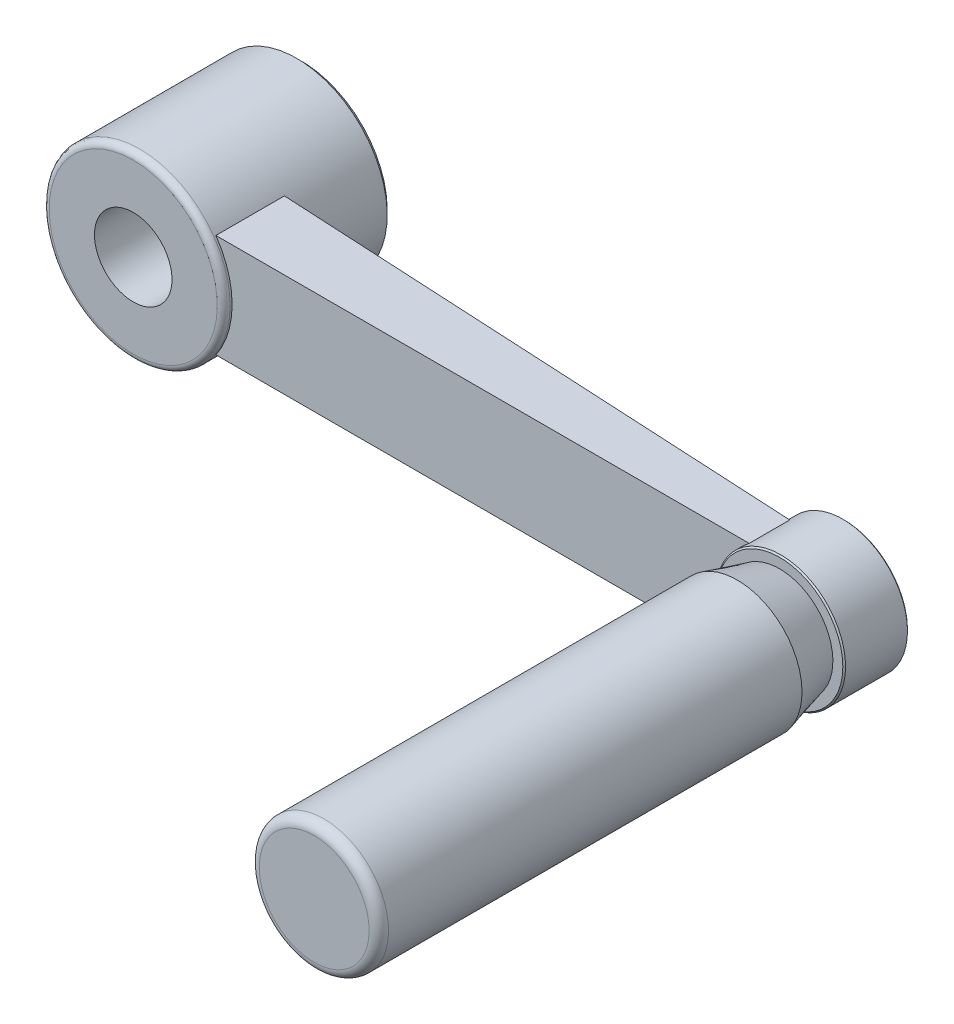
ISO-10303-21;
HEADER;
FILE_DESCRIPTION(('STEP AP214'),'2;1');
FILE_NAME('part.step','',(''),(''),'','','');
FILE_SCHEMA(('AUTOMOTIVE_DESIGN { 1 0 10303 214 1 1 1 1 }'));
ENDSEC;
DATA;
#1=APPLICATION_CONTEXT('core data for automotive mechanical design processes');
#2=APPLICATION_PROTOCOL_DEFINITION('international standard','automotive_design',2000,#1);
#3=PRODUCT_CONTEXT('',#1,'mechanical');
#4=PRODUCT('Part','Part','',(#3));
#5=PRODUCT_RELATED_PRODUCT_CATEGORY('part','',(#4));
#6=PRODUCT_DEFINITION_FORMATION('','',#4);
#7=PRODUCT_DEFINITION_CONTEXT('part definition',#1,'design');
#8=PRODUCT_DEFINITION('design','',#6,#7);
#9=PRODUCT_DEFINITION_SHAPE('','',#8);
#10=(LENGTH_UNIT() NAMED_UNIT(*) SI_UNIT(.MILLI.,.METRE.));
#11=(NAMED_UNIT(*) PLANE_ANGLE_UNIT() SI_UNIT($,.RADIAN.));
#12=(NAMED_UNIT(*) SI_UNIT($,.STERADIAN.) SOLID_ANGLE_UNIT());
#13=UNCERTAINTY_MEASURE_WITH_UNIT(LENGTH_MEASURE(1.E-05),#10,'distance_accuracy_value','');
#14=(GEOMETRIC_REPRESENTATION_CONTEXT(3) GLOBAL_UNCERTAINTY_ASSIGNED_CONTEXT((#13)) GLOBAL_UNIT_ASSIGNED_CONTEXT((#10,
#11,#12)) REPRESENTATION_CONTEXT('',''));
#15=CARTESIAN_POINT('',(0.,0.,0.));
#16=DIRECTION('',(0.,0.,1.));
#17=DIRECTION('',(1.,0.,0.));
#18=AXIS2_PLACEMENT_3D('',#15,#16,#17);
#19=CARTESIAN_POINT('',(102.3865,0.,17.));
#20=DIRECTION('',(0.,0.,1.));
#21=DIRECTION('',(0.,-1.,0.));
#22=AXIS2_PLACEMENT_3D('',#19,#20,#21);
#23=PLANE('',#22);
#24=CARTESIAN_POINT('',(100.,0.,17.0000000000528));
#25=DIRECTION('',(0.,0.,1.));
#26=DIRECTION('',(0.,-1.,0.));
#27=AXIS2_PLACEMENT_3D('',#24,#25,#26);
#28=CIRCLE('',#27,2.38650000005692);
#29=CARTESIAN_POINT('',(100.,-2.38650000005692,17.0000000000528));
#30=VERTEX_POINT('',#29);
#31=EDGE_CURVE('E17',#30,#30,#28,.T.);
#32=ORIENTED_EDGE('',*,*,#31,.F.);
#33=EDGE_LOOP('',(#32));
#34=FACE_BOUND('',#33,.T.);
#35=ADVANCED_FACE('F14',(#34),#23,.F.);
#36=CARTESIAN_POINT('',(100.,0.,17.0719999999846));
#37=DIRECTION('',(0.,0.,1.));
#38=DIRECTION('',(0.,-1.,0.));
#39=AXIS2_PLACEMENT_3D('',#36,#37,#38);
#40=CONICAL_SURFACE('',#39,2.45849999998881,0.785398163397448);
#41=CARTESIAN_POINT('',(100.,0.,17.072));
#42=DIRECTION('',(0.,0.,1.));
#43=DIRECTION('',(0.,-1.,0.));
#44=AXIS2_PLACEMENT_3D('',#41,#42,#43);
#45=CIRCLE('',#44,2.4585);
#46=CARTESIAN_POINT('',(100.,-2.4585,17.072));
#47=VERTEX_POINT('',#46);
#48=EDGE_CURVE('E117',#47,#47,#45,.F.);
#49=ORIENTED_EDGE('',*,*,#48,.T.);
#50=EDGE_LOOP('',(#49));
#51=FACE_BOUND('',#50,.T.);
#52=ORIENTED_EDGE('',*,*,#31,.T.);
#53=EDGE_LOOP('',(#52));
#54=FACE_BOUND('',#53,.T.);
#55=ADVANCED_FACE('F420',(#51,#54),#40,.T.);
#56=CARTESIAN_POINT('',(0.,0.,0.));
#57=DIRECTION('',(0.,0.,1.));
#58=DIRECTION('',(0.,-1.,0.));
#59=AXIS2_PLACEMENT_3D('',#56,#57,#58);
#60=CYLINDRICAL_SURFACE('',#59,6.);
#61=CARTESIAN_POINT('',(0.,0.,26.));
#62=DIRECTION('',(0.,0.,1.));
#63=DIRECTION('',(0.,-1.,0.));
#64=AXIS2_PLACEMENT_3D('',#61,#62,#63);
#65=CIRCLE('',#64,6.);
#66=CARTESIAN_POINT('',(0.,-6.,26.));
#67=VERTEX_POINT('',#66);
#68=EDGE_CURVE('E152',#67,#67,#65,.T.);
#69=ORIENTED_EDGE('',*,*,#68,.T.);
#70=EDGE_LOOP('',(#69));
#71=FACE_BOUND('',#70,.T.);
#72=CARTESIAN_POINT('',(0.,0.,0.));
#73=DIRECTION('',(0.,0.,1.));
#74=DIRECTION('',(0.,-1.,0.));
#75=AXIS2_PLACEMENT_3D('',#72,#73,#74);
#76=CIRCLE('',#75,6.);
#77=CARTESIAN_POINT('',(0.,-6.,0.));
#78=VERTEX_POINT('',#77);
#79=EDGE_CURVE('E125',#78,#78,#76,.F.);
#80=ORIENTED_EDGE('',*,*,#79,.T.);
#81=EDGE_LOOP('',(#80));
#82=FACE_BOUND('',#81,.T.);
#83=ADVANCED_FACE('F157',(#71,#82),#60,.F.);
#84=CARTESIAN_POINT('',(100.,0.,16.));
#85=DIRECTION('',(0.,0.,1.));
#86=DIRECTION('',(0.,-1.,0.));
#87=AXIS2_PLACEMENT_3D('',#84,#85,#86);
#88=CYLINDRICAL_SURFACE('',#87,2.4585);
#89=ORIENTED_EDGE('',*,*,#48,.F.);
#90=EDGE_LOOP('',(#89));
#91=FACE_BOUND('',#90,.T.);
#92=CARTESIAN_POINT('',(100.,0.,16.5415000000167));
#93=DIRECTION('',(0.,0.,-1.));
#94=DIRECTION('',(0.,1.,0.));
#95=AXIS2_PLACEMENT_3D('',#92,#93,#94);
#96=CIRCLE('',#95,2.45849999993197);
#97=CARTESIAN_POINT('',(100.,2.45849999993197,16.5415000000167));
#98=VERTEX_POINT('',#97);
#99=EDGE_CURVE('E97',#98,#98,#96,.T.);
#100=ORIENTED_EDGE('',*,*,#99,.T.);
#101=EDGE_LOOP('',(#100));
#102=FACE_BOUND('',#101,.T.);
#103=ADVANCED_FACE('F162',(#91,#102),#88,.F.);
#104=CARTESIAN_POINT('',(13.2928932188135,0.,0.));
#105=DIRECTION('',(0.,0.,1.));
#106=DIRECTION('',(0.,-1.,0.));
#107=AXIS2_PLACEMENT_3D('',#104,#105,#106);
#108=PLANE('',#107);
#109=CARTESIAN_POINT('',(0.,0.,0.));
#110=DIRECTION('',(0.,0.,1.));
#111=DIRECTION('',(0.,-1.,0.));
#112=AXIS2_PLACEMENT_3D('',#109,#110,#111);
#113=CIRCLE('',#112,13.2928932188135);
#114=CARTESIAN_POINT('',(0.,-13.2928932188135,0.));
#115=VERTEX_POINT('',#114);
#116=EDGE_CURVE('E149',#115,#115,#113,.T.);
#117=ORIENTED_EDGE('',*,*,#116,.F.);
#118=EDGE_LOOP('',(#117));
#119=FACE_BOUND('',#118,.T.);
#120=ORIENTED_EDGE('',*,*,#79,.F.);
#121=EDGE_LOOP('',(#120));
#122=FACE_BOUND('',#121,.T.);
#123=ADVANCED_FACE('F159',(#119,#122),#108,.F.);
#124=CARTESIAN_POINT('',(0.,0.,26.));
#125=DIRECTION('',(0.,0.,-1.));
#126=DIRECTION('',(0.,1.,0.));
#127=AXIS2_PLACEMENT_3D('',#124,#125,#126);
#128=PLANE('',#127);
#129=ORIENTED_EDGE('',*,*,#68,.F.);
#130=EDGE_LOOP('',(#129));
#131=FACE_BOUND('',#130,.T.);
#132=CARTESIAN_POINT('',(0.,0.,26.));
#133=DIRECTION('',(0.,0.,-1.));
#134=DIRECTION('',(0.,1.,0.));
#135=AXIS2_PLACEMENT_3D('',#132,#133,#134);
#136=CIRCLE('',#135,13.);
#137=CARTESIAN_POINT('',(0.,13.,26.));
#138=VERTEX_POINT('',#137);
#139=EDGE_CURVE('E148',#138,#138,#136,.T.);
#140=ORIENTED_EDGE('',*,*,#139,.F.);
#141=EDGE_LOOP('',(#140));
#142=FACE_BOUND('',#141,.T.);
#143=ADVANCED_FACE('F161',(#131,#142),#128,.F.);
#144=CARTESIAN_POINT('',(100.,0.,16.0000000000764));
#145=DIRECTION('',(0.,0.,-1.));
#146=DIRECTION('',(0.,1.,0.));
#147=AXIS2_PLACEMENT_3D('',#144,#145,#146);
#148=CONICAL_SURFACE('',#147,2.99999999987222,0.785398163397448);
#149=ORIENTED_EDGE('',*,*,#99,.F.);
#150=EDGE_LOOP('',(#149));
#151=FACE_BOUND('',#150,.T.);
#152=CARTESIAN_POINT('',(100.,0.,16.0000000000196));
#153=DIRECTION('',(0.,0.,-1.));
#154=DIRECTION('',(0.,1.,0.));
#155=AXIS2_PLACEMENT_3D('',#152,#153,#154);
#156=CIRCLE('',#155,2.99999999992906);
#157=CARTESIAN_POINT('',(100.,2.99999999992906,16.0000000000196));
#158=VERTEX_POINT('',#157);
#159=EDGE_CURVE('E92',#158,#158,#156,.F.);
#160=ORIENTED_EDGE('',*,*,#159,.F.);
#161=EDGE_LOOP('',(#160));
#162=FACE_BOUND('',#161,.T.);
#163=ADVANCED_FACE('F170',(#151,#162),#148,.F.);
#164=CARTESIAN_POINT('',(0.,0.,0.707106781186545));
#165=DIRECTION('',(0.,0.,1.));
#166=DIRECTION('',(0.,-1.,0.));
#167=AXIS2_PLACEMENT_3D('',#164,#165,#166);
#168=CONICAL_SURFACE('',#167,14.,0.78539816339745);
#169=CARTESIAN_POINT('',(0.,0.,0.707106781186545));
#170=DIRECTION('',(0.,0.,1.));
#171=DIRECTION('',(0.,-1.,0.));
#172=AXIS2_PLACEMENT_3D('',#169,#170,#171);
#173=CIRCLE('',#172,14.);
#174=CARTESIAN_POINT('',(0.,-14.,0.707106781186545));
#175=VERTEX_POINT('',#174);
#176=EDGE_CURVE('E87',#175,#175,#173,.T.);
#177=ORIENTED_EDGE('',*,*,#176,.F.);
#178=EDGE_LOOP('',(#177));
#179=FACE_BOUND('',#178,.T.);
#180=ORIENTED_EDGE('',*,*,#116,.T.);
#181=EDGE_LOOP('',(#180));
#182=FACE_BOUND('',#181,.T.);
#183=ADVANCED_FACE('F106',(#179,#182),#168,.T.);
#184=CARTESIAN_POINT('',(0.,0.,25.));
#185=DIRECTION('',(0.,0.,-1.));
#186=DIRECTION('',(0.,1.,0.));
#187=AXIS2_PLACEMENT_3D('',#184,#185,#186);
#188=TOROIDAL_SURFACE('',#187,13.,1.);
#189=CARTESIAN_POINT('',(0.,0.,25.));
#190=DIRECTION('',(0.,0.,1.));
#191=DIRECTION('',(0.,-1.,0.));
#192=AXIS2_PLACEMENT_3D('',#189,#190,#191);
#193=CIRCLE('',#192,14.);
#194=CARTESIAN_POINT('',(0.,-14.,25.));
#195=VERTEX_POINT('',#194);
#196=EDGE_CURVE('E84',#195,#195,#193,.F.);
#197=ORIENTED_EDGE('',*,*,#196,.F.);
#198=EDGE_LOOP('',(#197));
#199=FACE_BOUND('',#198,.T.);
#200=ORIENTED_EDGE('',*,*,#139,.T.);
#201=EDGE_LOOP('',(#200));
#202=FACE_BOUND('',#201,.T.);
#203=ADVANCED_FACE('F100',(#199,#202),#188,.T.);
#204=CARTESIAN_POINT('',(103.,0.,16.));
#205=DIRECTION('',(0.,0.,-1.));
#206=DIRECTION('',(0.,1.,0.));
#207=AXIS2_PLACEMENT_3D('',#204,#205,#206);
#208=PLANE('',#207);
#209=ORIENTED_EDGE('',*,*,#159,.T.);
#210=EDGE_LOOP('',(#209));
#211=FACE_BOUND('',#210,.T.);
#212=CARTESIAN_POINT('',(100.,0.,16.));
#213=DIRECTION('',(0.,0.,1.));
#214=DIRECTION('',(0.,-1.,0.));
#215=AXIS2_PLACEMENT_3D('',#212,#213,#214);
#216=CIRCLE('',#215,9.78786796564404);
#217=CARTESIAN_POINT('',(100.,-9.78786796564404,16.));
#218=VERTEX_POINT('',#217);
#219=EDGE_CURVE('E63',#218,#218,#216,.T.);
#220=ORIENTED_EDGE('',*,*,#219,.F.);
#221=EDGE_LOOP('',(#220));
#222=FACE_BOUND('',#221,.T.);
#223=ADVANCED_FACE('F105',(#211,#222),#208,.T.);
#224=CARTESIAN_POINT('',(0.,0.,0.));
#225=DIRECTION('',(0.,0.,1.));
#226=DIRECTION('',(0.,-1.,0.));
#227=AXIS2_PLACEMENT_3D('',#224,#225,#226);
#228=CYLINDRICAL_SURFACE('',#227,14.);
#229=ORIENTED_EDGE('',*,*,#196,.T.);
#230=EDGE_LOOP('',(#229));
#231=FACE_BOUND('',#230,.T.);
#232=CARTESIAN_POINT('',(0.,0.,13.5));
#233=DIRECTION('',(-0.0523359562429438,0.,0.998629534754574));
#234=DIRECTION('',(0.998629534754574,0.,0.0523359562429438));
#235=AXIS2_PLACEMENT_3D('',#232,#233,#234);
#236=ELLIPSE('',#235,14.0192128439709,14.);
#237=CARTESIAN_POINT('',(11.4891252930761,8.,14.1021195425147));
#238=VERTEX_POINT('',#237);
#239=CARTESIAN_POINT('',(11.4891252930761,-8.,14.1021195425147));
#240=VERTEX_POINT('',#239);
#241=EDGE_CURVE('E53',#238,#240,#236,.F.);
#242=ORIENTED_EDGE('',*,*,#241,.T.);
#243=DIRECTION('',(0.,0.,1.));
#244=VECTOR('',#243,1.);
#245=CARTESIAN_POINT('',(11.4891252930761,-8.,0.));
#246=LINE('',#245,#244);
#247=CARTESIAN_POINT('',(11.4891252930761,-8.,24.7));
#248=VERTEX_POINT('',#247);
#249=EDGE_CURVE('E82',#240,#248,#246,.T.);
#250=ORIENTED_EDGE('',*,*,#249,.T.);
#251=CARTESIAN_POINT('',(0.,0.,24.7));
#252=DIRECTION('',(0.,0.,1.));
#253=DIRECTION('',(0.,-1.,0.));
#254=AXIS2_PLACEMENT_3D('',#251,#252,#253);
#255=CIRCLE('',#254,14.);
#256=CARTESIAN_POINT('',(11.4891252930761,8.,24.7));
#257=VERTEX_POINT('',#256);
#258=EDGE_CURVE('E69',#248,#257,#255,.T.);
#259=ORIENTED_EDGE('',*,*,#258,.T.);
#260=DIRECTION('',(0.,0.,1.));
#261=VECTOR('',#260,1.);
#262=CARTESIAN_POINT('',(11.4891252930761,8.,0.));
#263=LINE('',#262,#261);
#264=EDGE_CURVE('E66',#238,#257,#263,.T.);
#265=ORIENTED_EDGE('',*,*,#264,.F.);
#266=EDGE_LOOP('',(#242,#250,#259,#265));
#267=FACE_BOUND('',#266,.T.);
#268=ORIENTED_EDGE('',*,*,#176,.T.);
#269=EDGE_LOOP('',(#268));
#270=FACE_BOUND('',#269,.T.);
#271=ADVANCED_FACE('F67',(#231,#267,#270),#228,.T.);
#272=CARTESIAN_POINT('',(100.,0.,16.212132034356));
#273=DIRECTION('',(0.,0.,1.));
#274=DIRECTION('',(0.,-1.,0.));
#275=AXIS2_PLACEMENT_3D('',#272,#273,#274);
#276=CONICAL_SURFACE('',#275,10.,0.785398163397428);
#277=ORIENTED_EDGE('',*,*,#219,.T.);
#278=EDGE_LOOP('',(#277));
#279=FACE_BOUND('',#278,.T.);
#280=CARTESIAN_POINT('',(100.,0.,16.212132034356));
#281=DIRECTION('',(0.,0.,1.));
#282=DIRECTION('',(0.,-1.,0.));
#283=AXIS2_PLACEMENT_3D('',#280,#281,#282);
#284=CIRCLE('',#283,10.);
#285=CARTESIAN_POINT('',(100.,-10.,16.212132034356));
#286=VERTEX_POINT('',#285);
#287=EDGE_CURVE('E142',#286,#286,#284,.T.);
#288=ORIENTED_EDGE('',*,*,#287,.F.);
#289=EDGE_LOOP('',(#288));
#290=FACE_BOUND('',#289,.T.);
#291=ADVANCED_FACE('F237',(#279,#290),#276,.T.);
#292=CARTESIAN_POINT('',(0.,-8.,13.5));
#293=DIRECTION('',(-0.0523359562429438,0.,0.998629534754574));
#294=DIRECTION('',(-0.998629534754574,0.,-0.0523359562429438));
#295=AXIS2_PLACEMENT_3D('',#292,#293,#294);
#296=PLANE('',#295);
#297=CARTESIAN_POINT('',(100.,0.,18.7407779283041));
#298=DIRECTION('',(-0.0523359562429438,0.,0.998629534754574));
#299=DIRECTION('',(0.998629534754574,0.,0.0523359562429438));
#300=AXIS2_PLACEMENT_3D('',#297,#298,#299);
#301=ELLIPSE('',#300,10.0137234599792,10.);
#302=CARTESIAN_POINT('',(94.,-8.,18.4263312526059));
#303=VERTEX_POINT('',#302);
#304=CARTESIAN_POINT('',(94.,8.,18.4263312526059));
#305=VERTEX_POINT('',#304);
#306=EDGE_CURVE('E140',#303,#305,#301,.F.);
#307=ORIENTED_EDGE('',*,*,#306,.F.);
#308=DIRECTION('',(-0.998629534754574,0.,-0.0523359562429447));
#309=VECTOR('',#308,1.);
#310=CARTESIAN_POINT('',(94.,-8.,18.4263312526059));
#311=LINE('',#310,#309);
#312=EDGE_CURVE('E60',#303,#240,#311,.T.);
#313=ORIENTED_EDGE('',*,*,#312,.T.);
#314=ORIENTED_EDGE('',*,*,#241,.F.);
#315=DIRECTION('',(-0.998629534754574,0.,-0.0523359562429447));
#316=VECTOR('',#315,1.);
#317=CARTESIAN_POINT('',(94.,8.,18.4263312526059));
#318=LINE('',#317,#316);
#319=EDGE_CURVE('E57',#305,#238,#318,.T.);
#320=ORIENTED_EDGE('',*,*,#319,.F.);
#321=EDGE_LOOP('',(#307,#313,#314,#320));
#322=FACE_BOUND('',#321,.T.);
#323=ADVANCED_FACE('F55',(#322),#296,.F.);
#324=CARTESIAN_POINT('',(0.,8.,0.));
#325=DIRECTION('',(0.,1.,0.));
#326=DIRECTION('',(-1.,0.,0.));
#327=AXIS2_PLACEMENT_3D('',#324,#325,#326);
#328=PLANE('',#327);
#329=ORIENTED_EDGE('',*,*,#264,.T.);
#330=DIRECTION('',(1.,0.,0.));
#331=VECTOR('',#330,1.);
#332=CARTESIAN_POINT('',(96.,8.,24.7));
#333=LINE('',#332,#331);
#334=CARTESIAN_POINT('',(94.,8.,24.7));
#335=VERTEX_POINT('',#334);
#336=EDGE_CURVE('E80',#257,#335,#333,.T.);
#337=ORIENTED_EDGE('',*,*,#336,.T.);
#338=DIRECTION('',(0.,0.,1.));
#339=VECTOR('',#338,1.);
#340=CARTESIAN_POINT('',(94.,8.,16.));
#341=LINE('',#340,#339);
#342=EDGE_CURVE('E75',#305,#335,#341,.T.);
#343=ORIENTED_EDGE('',*,*,#342,.F.);
#344=ORIENTED_EDGE('',*,*,#319,.T.);
#345=EDGE_LOOP('',(#329,#337,#343,#344));
#346=FACE_BOUND('',#345,.T.);
#347=ADVANCED_FACE('F73',(#346),#328,.T.);
#348=CARTESIAN_POINT('',(96.,-8.,24.7));
#349=DIRECTION('',(0.,0.,-1.));
#350=DIRECTION('',(0.,1.,0.));
#351=AXIS2_PLACEMENT_3D('',#348,#349,#350);
#352=PLANE('',#351);
#353=CARTESIAN_POINT('',(100.,0.,24.7));
#354=DIRECTION('',(0.,0.,1.));
#355=DIRECTION('',(0.,-1.,0.));
#356=AXIS2_PLACEMENT_3D('',#353,#354,#355);
#357=CIRCLE('',#356,10.);
#358=CARTESIAN_POINT('',(94.,-8.,24.7));
#359=VERTEX_POINT('',#358);
#360=EDGE_CURVE('E136',#335,#359,#357,.T.);
#361=ORIENTED_EDGE('',*,*,#360,.F.);
#362=ORIENTED_EDGE('',*,*,#336,.F.);
#363=ORIENTED_EDGE('',*,*,#258,.F.);
#364=DIRECTION('',(-1.,0.,0.));
#365=VECTOR('',#364,1.);
#366=CARTESIAN_POINT('',(0.,-8.,24.7));
#367=LINE('',#366,#365);
#368=EDGE_CURVE('E32',#248,#359,#367,.F.);
#369=ORIENTED_EDGE('',*,*,#368,.T.);
#370=EDGE_LOOP('',(#361,#362,#363,#369));
#371=FACE_BOUND('',#370,.T.);
#372=ADVANCED_FACE('F229',(#371),#352,.F.);
#373=CARTESIAN_POINT('',(0.,-8.,0.));
#374=DIRECTION('',(0.,1.,0.));
#375=DIRECTION('',(-1.,0.,0.));
#376=AXIS2_PLACEMENT_3D('',#373,#374,#375);
#377=PLANE('',#376);
#378=DIRECTION('',(0.,0.,1.));
#379=VECTOR('',#378,1.);
#380=CARTESIAN_POINT('',(94.,-8.,16.));
#381=LINE('',#380,#379);
#382=EDGE_CURVE('E139',#359,#303,#381,.F.);
#383=ORIENTED_EDGE('',*,*,#382,.F.);
#384=ORIENTED_EDGE('',*,*,#368,.F.);
#385=ORIENTED_EDGE('',*,*,#249,.F.);
#386=ORIENTED_EDGE('',*,*,#312,.F.);
#387=EDGE_LOOP('',(#383,#384,#385,#386));
#388=FACE_BOUND('',#387,.T.);
#389=ADVANCED_FACE('F225',(#388),#377,.F.);
#390=CARTESIAN_POINT('',(100.,0.,16.));
#391=DIRECTION('',(0.,0.,1.));
#392=DIRECTION('',(0.,-1.,0.));
#393=AXIS2_PLACEMENT_3D('',#390,#391,#392);
#394=CYLINDRICAL_SURFACE('',#393,10.);
#395=ORIENTED_EDGE('',*,*,#360,.T.);
#396=ORIENTED_EDGE('',*,*,#382,.T.);
#397=ORIENTED_EDGE('',*,*,#306,.T.);
#398=ORIENTED_EDGE('',*,*,#342,.T.);
#399=EDGE_LOOP('',(#395,#396,#397,#398));
#400=FACE_BOUND('',#399,.T.);
#401=ORIENTED_EDGE('',*,*,#287,.T.);
#402=EDGE_LOOP('',(#401));
#403=FACE_BOUND('',#402,.T.);
#404=CARTESIAN_POINT('',(100.,0.,25.787867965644));
#405=DIRECTION('',(0.,0.,-1.));
#406=DIRECTION('',(0.,1.,0.));
#407=AXIS2_PLACEMENT_3D('',#404,#405,#406);
#408=CIRCLE('',#407,10.);
#409=CARTESIAN_POINT('',(100.,10.,25.787867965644));
#410=VERTEX_POINT('',#409);
#411=EDGE_CURVE('E135',#410,#410,#408,.F.);
#412=ORIENTED_EDGE('',*,*,#411,.F.);
#413=EDGE_LOOP('',(#412));
#414=FACE_BOUND('',#413,.T.);
#415=ADVANCED_FACE('F221',(#400,#403,#414),#394,.T.);
#416=CARTESIAN_POINT('',(100.,0.,25.787867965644));
#417=DIRECTION('',(0.,0.,-1.));
#418=DIRECTION('',(1.,0.,0.));
#419=AXIS2_PLACEMENT_3D('',#416,#417,#418);
#420=CONICAL_SURFACE('',#419,10.,0.785398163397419);
#421=ORIENTED_EDGE('',*,*,#411,.T.);
#422=EDGE_LOOP('',(#421));
#423=FACE_BOUND('',#422,.T.);
#424=CARTESIAN_POINT('',(100.,0.,26.));
#425=DIRECTION('',(0.,0.,-1.));
#426=DIRECTION('',(1.,0.,0.));
#427=AXIS2_PLACEMENT_3D('',#424,#425,#426);
#428=CIRCLE('',#427,9.78786796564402);
#429=CARTESIAN_POINT('',(109.787867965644,0.,26.));
#430=VERTEX_POINT('',#429);
#431=EDGE_CURVE('E132',#430,#430,#428,.F.);
#432=ORIENTED_EDGE('',*,*,#431,.F.);
#433=EDGE_LOOP('',(#432));
#434=FACE_BOUND('',#433,.T.);
#435=ADVANCED_FACE('F217',(#423,#434),#420,.T.);
#436=CARTESIAN_POINT('',(109.787867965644,0.,26.));
#437=DIRECTION('',(0.,0.,1.));
#438=DIRECTION('',(0.,-1.,0.));
#439=AXIS2_PLACEMENT_3D('',#436,#437,#438);
#440=PLANE('',#439);
#441=ORIENTED_EDGE('',*,*,#431,.T.);
#442=EDGE_LOOP('',(#441));
#443=FACE_BOUND('',#442,.T.);
#444=CARTESIAN_POINT('',(100.,0.,26.));
#445=DIRECTION('',(0.,0.,1.));
#446=DIRECTION('',(0.,-1.,0.));
#447=AXIS2_PLACEMENT_3D('',#444,#445,#446);
#448=CIRCLE('',#447,8.25);
#449=CARTESIAN_POINT('',(100.,-8.25,26.));
#450=VERTEX_POINT('',#449);
#451=EDGE_CURVE('E128',#450,#450,#448,.T.);
#452=ORIENTED_EDGE('',*,*,#451,.F.);
#453=EDGE_LOOP('',(#452));
#454=FACE_BOUND('',#453,.T.);
#455=ADVANCED_FACE('F214',(#443,#454),#440,.T.);
#456=CARTESIAN_POINT('',(100.,0.,98.));
#457=DIRECTION('',(0.,0.,-1.));
#458=DIRECTION('',(0.,1.,0.));
#459=AXIS2_PLACEMENT_3D('',#456,#457,#458);
#460=PLANE('',#459);
#461=CARTESIAN_POINT('',(100.,0.,98.));
#462=DIRECTION('',(0.,0.,-1.));
#463=DIRECTION('',(0.,1.,0.));
#464=AXIS2_PLACEMENT_3D('',#461,#462,#463);
#465=CIRCLE('',#464,8.50000000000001);
#466=CARTESIAN_POINT('',(100.,8.50000000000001,98.));
#467=VERTEX_POINT('',#466);
#468=EDGE_CURVE('E131',#467,#467,#465,.T.);
#469=ORIENTED_EDGE('',*,*,#468,.F.);
#470=EDGE_LOOP('',(#469));
#471=FACE_BOUND('',#470,.T.);
#472=ADVANCED_FACE('F205',(#471),#460,.F.);
#473=CARTESIAN_POINT('',(100.,0.,32.5310889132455));
#474=DIRECTION('',(0.,0.,1.));
#475=DIRECTION('',(0.,-1.,0.));
#476=AXIS2_PLACEMENT_3D('',#473,#474,#475);
#477=CONICAL_SURFACE('',#476,10.,0.26179938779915);
#478=CARTESIAN_POINT('',(100.,0.,32.5310889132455));
#479=DIRECTION('',(0.,0.,1.));
#480=DIRECTION('',(0.,-1.,0.));
#481=AXIS2_PLACEMENT_3D('',#478,#479,#480);
#482=CIRCLE('',#481,10.);
#483=CARTESIAN_POINT('',(100.,-10.,32.5310889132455));
#484=VERTEX_POINT('',#483);
#485=EDGE_CURVE('E23',#484,#484,#482,.T.);
#486=ORIENTED_EDGE('',*,*,#485,.F.);
#487=EDGE_LOOP('',(#486));
#488=FACE_BOUND('',#487,.T.);
#489=ORIENTED_EDGE('',*,*,#451,.T.);
#490=EDGE_LOOP('',(#489));
#491=FACE_BOUND('',#490,.T.);
#492=ADVANCED_FACE('F184',(#488,#491),#477,.T.);
#493=CARTESIAN_POINT('',(100.,0.,96.5));
#494=DIRECTION('',(0.,0.,-1.));
#495=DIRECTION('',(0.,1.,0.));
#496=AXIS2_PLACEMENT_3D('',#493,#494,#495);
#497=TOROIDAL_SURFACE('',#496,8.5,1.50000000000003);
#498=CARTESIAN_POINT('',(100.,0.,96.5));
#499=DIRECTION('',(0.,0.,1.));
#500=DIRECTION('',(0.,-1.,0.));
#501=AXIS2_PLACEMENT_3D('',#498,#499,#500);
#502=CIRCLE('',#501,10.);
#503=CARTESIAN_POINT('',(100.,-10.,96.5));
#504=VERTEX_POINT('',#503);
#505=EDGE_CURVE('E9',#504,#504,#502,.F.);
#506=ORIENTED_EDGE('',*,*,#505,.F.);
#507=EDGE_LOOP('',(#506));
#508=FACE_BOUND('',#507,.T.);
#509=ORIENTED_EDGE('',*,*,#468,.T.);
#510=EDGE_LOOP('',(#509));
#511=FACE_BOUND('',#510,.T.);
#512=ADVANCED_FACE('F178',(#508,#511),#497,.T.);
#513=CARTESIAN_POINT('',(100.,0.,17.));
#514=DIRECTION('',(0.,0.,1.));
#515=DIRECTION('',(0.,-1.,0.));
#516=AXIS2_PLACEMENT_3D('',#513,#514,#515);
#517=CYLINDRICAL_SURFACE('',#516,10.);
#518=ORIENTED_EDGE('',*,*,#505,.T.);
#519=EDGE_LOOP('',(#518));
#520=FACE_BOUND('',#519,.T.);
#521=ORIENTED_EDGE('',*,*,#485,.T.);
#522=EDGE_LOOP('',(#521));
#523=FACE_BOUND('',#522,.T.);
#524=ADVANCED_FACE('F176',(#520,#523),#517,.T.);
#525=CLOSED_SHELL('',(#35,#55,#83,#103,#123,#143,#163,#183,#203,#223,#271,#291,#323,#347,#372,
#389,#415,#435,#455,#472,#492,#512,#524));
#526=MANIFOLD_SOLID_BREP('B1',#525);
#527=ADVANCED_BREP_SHAPE_REPRESENTATION('',(#18,#526),#14);
#528=SHAPE_DEFINITION_REPRESENTATION(#9,#527);
ENDSEC;
END-ISO-10303-21;
